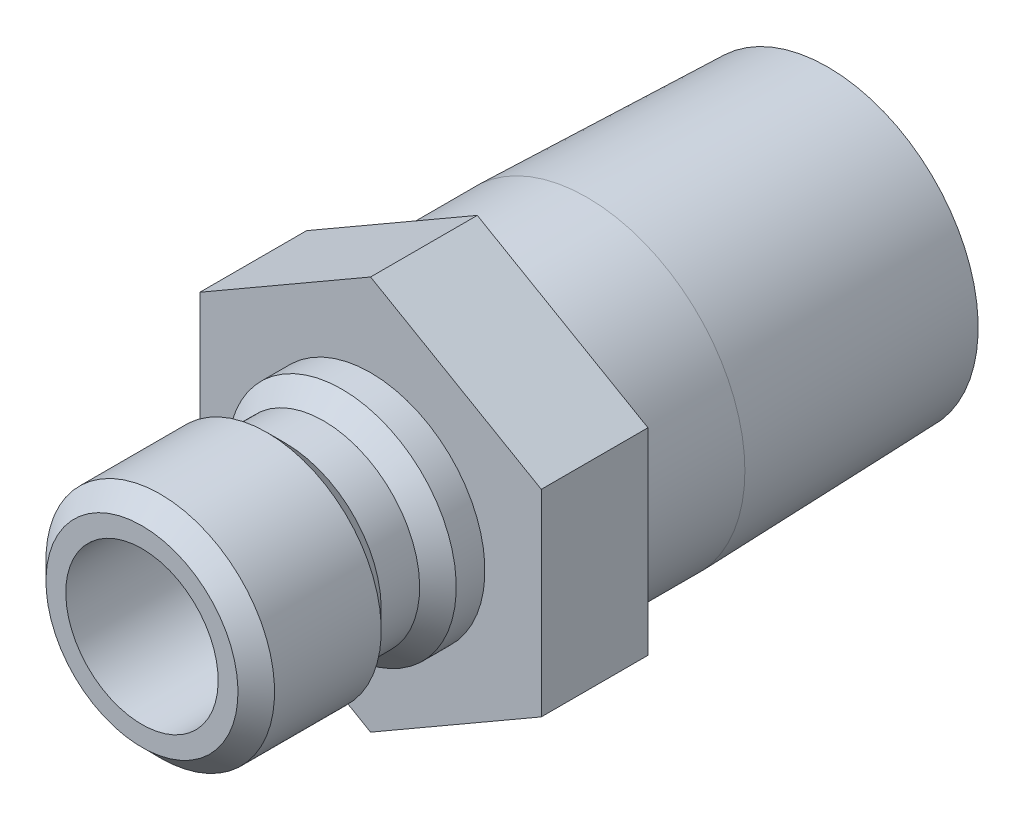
ISO-10303-21;
HEADER;
FILE_DESCRIPTION(('STEP AP214'),'2;1');
FILE_NAME('part.step','',(''),(''),'','','');
FILE_SCHEMA(('AUTOMOTIVE_DESIGN { 1 0 10303 214 1 1 1 1 }'));
ENDSEC;
DATA;
#1=APPLICATION_CONTEXT('core data for automotive mechanical design processes');
#2=APPLICATION_PROTOCOL_DEFINITION('international standard','automotive_design',2000,#1);
#3=PRODUCT_CONTEXT('',#1,'mechanical');
#4=PRODUCT('Part','Part','',(#3));
#5=PRODUCT_RELATED_PRODUCT_CATEGORY('part','',(#4));
#6=PRODUCT_DEFINITION_FORMATION('','',#4);
#7=PRODUCT_DEFINITION_CONTEXT('part definition',#1,'design');
#8=PRODUCT_DEFINITION('design','',#6,#7);
#9=PRODUCT_DEFINITION_SHAPE('','',#8);
#10=(LENGTH_UNIT() NAMED_UNIT(*) SI_UNIT(.MILLI.,.METRE.));
#11=(NAMED_UNIT(*) PLANE_ANGLE_UNIT() SI_UNIT($,.RADIAN.));
#12=(NAMED_UNIT(*) SI_UNIT($,.STERADIAN.) SOLID_ANGLE_UNIT());
#13=UNCERTAINTY_MEASURE_WITH_UNIT(LENGTH_MEASURE(1.E-05),#10,'distance_accuracy_value','');
#14=(GEOMETRIC_REPRESENTATION_CONTEXT(3) GLOBAL_UNCERTAINTY_ASSIGNED_CONTEXT((#13)) GLOBAL_UNIT_ASSIGNED_CONTEXT((#10,
#11,#12)) REPRESENTATION_CONTEXT('',''));
#15=CARTESIAN_POINT('',(0.,0.,0.));
#16=DIRECTION('',(0.,0.,1.));
#17=DIRECTION('',(1.,0.,0.));
#18=AXIS2_PLACEMENT_3D('',#15,#16,#17);
#19=CARTESIAN_POINT('',(0.,0.,0.));
#20=DIRECTION('',(0.,0.,-1.));
#21=DIRECTION('',(0.,1.,0.));
#22=AXIS2_PLACEMENT_3D('',#19,#20,#21);
#23=CYLINDRICAL_SURFACE('',#22,3.175);
#24=CARTESIAN_POINT('',(0.,0.,9.525));
#25=DIRECTION('',(0.,0.,-1.));
#26=DIRECTION('',(0.,1.,0.));
#27=AXIS2_PLACEMENT_3D('',#24,#25,#26);
#28=CIRCLE('',#27,3.175);
#29=CARTESIAN_POINT('',(0.,3.175,9.525));
#30=VERTEX_POINT('',#29);
#31=EDGE_CURVE('E151',#30,#30,#28,.T.);
#32=ORIENTED_EDGE('',*,*,#31,.F.);
#33=EDGE_LOOP('',(#32));
#34=FACE_BOUND('',#33,.T.);
#35=CARTESIAN_POINT('',(0.,0.,-4.445));
#36=DIRECTION('',(0.,0.,1.));
#37=DIRECTION('',(1.,0.,0.));
#38=AXIS2_PLACEMENT_3D('',#35,#36,#37);
#39=CIRCLE('',#38,3.175);
#40=CARTESIAN_POINT('',(3.175,0.,-4.445));
#41=VERTEX_POINT('',#40);
#42=EDGE_CURVE('E129',#41,#41,#39,.T.);
#43=ORIENTED_EDGE('',*,*,#42,.F.);
#44=EDGE_LOOP('',(#43));
#45=FACE_BOUND('',#44,.T.);
#46=ADVANCED_FACE('F37',(#34,#45),#23,.F.);
#47=CARTESIAN_POINT('',(0.,4.7625,0.));
#48=DIRECTION('',(0.,0.,1.));
#49=DIRECTION('',(0.,-1.,0.));
#50=AXIS2_PLACEMENT_3D('',#47,#48,#49);
#51=PLANE('',#50);
#52=CARTESIAN_POINT('',(0.,0.,0.));
#53=DIRECTION('',(0.,0.,-1.));
#54=DIRECTION('',(0.,1.,0.));
#55=AXIS2_PLACEMENT_3D('',#52,#53,#54);
#56=CIRCLE('',#55,4.7625);
#57=CARTESIAN_POINT('',(0.,4.7625,0.));
#58=VERTEX_POINT('',#57);
#59=EDGE_CURVE('E172',#58,#58,#56,.T.);
#60=ORIENTED_EDGE('',*,*,#59,.T.);
#61=EDGE_LOOP('',(#60));
#62=FACE_BOUND('',#61,.T.);
#63=DIRECTION('',(-0.866025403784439,-0.5,0.));
#64=VECTOR('',#63,1.);
#65=CARTESIAN_POINT('',(0.,8.21223022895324,0.));
#66=LINE('',#65,#64);
#67=CARTESIAN_POINT('',(0.,8.21223022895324,0.));
#68=VERTEX_POINT('',#67);
#69=CARTESIAN_POINT('',(-7.112,4.10611511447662,0.));
#70=VERTEX_POINT('',#69);
#71=EDGE_CURVE('E125',#68,#70,#66,.T.);
#72=ORIENTED_EDGE('',*,*,#71,.T.);
#73=DIRECTION('',(0.,-1.,0.));
#74=VECTOR('',#73,1.);
#75=CARTESIAN_POINT('',(-7.112,4.10611511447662,0.));
#76=LINE('',#75,#74);
#77=CARTESIAN_POINT('',(-7.112,-4.10611511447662,0.));
#78=VERTEX_POINT('',#77);
#79=EDGE_CURVE('E128',#70,#78,#76,.T.);
#80=ORIENTED_EDGE('',*,*,#79,.T.);
#81=DIRECTION('',(0.866025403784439,-0.5,0.));
#82=VECTOR('',#81,1.);
#83=CARTESIAN_POINT('',(-7.112,-4.10611511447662,0.));
#84=LINE('',#83,#82);
#85=CARTESIAN_POINT('',(0.,-8.21223022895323,0.));
#86=VERTEX_POINT('',#85);
#87=EDGE_CURVE('E132',#78,#86,#84,.T.);
#88=ORIENTED_EDGE('',*,*,#87,.T.);
#89=DIRECTION('',(0.866025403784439,0.5,0.));
#90=VECTOR('',#89,1.);
#91=CARTESIAN_POINT('',(0.,-8.21223022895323,0.));
#92=LINE('',#91,#90);
#93=CARTESIAN_POINT('',(7.112,-4.10611511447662,0.));
#94=VERTEX_POINT('',#93);
#95=EDGE_CURVE('E135',#86,#94,#92,.T.);
#96=ORIENTED_EDGE('',*,*,#95,.T.);
#97=DIRECTION('',(0.,1.,0.));
#98=VECTOR('',#97,1.);
#99=CARTESIAN_POINT('',(7.112,-4.10611511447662,0.));
#100=LINE('',#99,#98);
#101=CARTESIAN_POINT('',(7.112,4.10611511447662,0.));
#102=VERTEX_POINT('',#101);
#103=EDGE_CURVE('E102',#94,#102,#100,.T.);
#104=ORIENTED_EDGE('',*,*,#103,.T.);
#105=DIRECTION('',(-0.866025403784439,0.5,0.));
#106=VECTOR('',#105,1.);
#107=CARTESIAN_POINT('',(7.112,4.10611511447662,0.));
#108=LINE('',#107,#106);
#109=EDGE_CURVE('E138',#102,#68,#108,.T.);
#110=ORIENTED_EDGE('',*,*,#109,.T.);
#111=EDGE_LOOP('',(#72,#80,#88,#96,#104,#110));
#112=FACE_BOUND('',#111,.T.);
#113=ADVANCED_FACE('F199',(#62,#112),#51,.T.);
#114=CARTESIAN_POINT('',(0.,0.,0.));
#115=DIRECTION('',(0.,0.,-1.));
#116=DIRECTION('',(0.,1.,0.));
#117=AXIS2_PLACEMENT_3D('',#114,#115,#116);
#118=CYLINDRICAL_SURFACE('',#117,4.7625);
#119=CARTESIAN_POINT('',(0.,0.,1.1938));
#120=DIRECTION('',(0.,0.,-1.));
#121=DIRECTION('',(0.,1.,0.));
#122=AXIS2_PLACEMENT_3D('',#119,#120,#121);
#123=CIRCLE('',#122,4.7625);
#124=CARTESIAN_POINT('',(0.,4.7625,1.1938));
#125=VERTEX_POINT('',#124);
#126=EDGE_CURVE('E169',#125,#125,#123,.T.);
#127=ORIENTED_EDGE('',*,*,#126,.T.);
#128=EDGE_LOOP('',(#127));
#129=FACE_BOUND('',#128,.T.);
#130=ORIENTED_EDGE('',*,*,#59,.F.);
#131=EDGE_LOOP('',(#130));
#132=FACE_BOUND('',#131,.T.);
#133=ADVANCED_FACE('F204',(#129,#132),#118,.T.);
#134=CARTESIAN_POINT('',(0.,0.,1.1938));
#135=DIRECTION('',(0.,0.,-1.));
#136=DIRECTION('',(0.,1.,0.));
#137=AXIS2_PLACEMENT_3D('',#134,#135,#136);
#138=CONICAL_SURFACE('',#137,4.7625,0.785398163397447);
#139=CARTESIAN_POINT('',(0.,0.,1.9558));
#140=DIRECTION('',(0.,0.,-1.));
#141=DIRECTION('',(0.,1.,0.));
#142=AXIS2_PLACEMENT_3D('',#139,#140,#141);
#143=CIRCLE('',#142,4.0005);
#144=CARTESIAN_POINT('',(0.,4.0005,1.9558));
#145=VERTEX_POINT('',#144);
#146=EDGE_CURVE('E166',#145,#145,#143,.T.);
#147=ORIENTED_EDGE('',*,*,#146,.T.);
#148=EDGE_LOOP('',(#147));
#149=FACE_BOUND('',#148,.T.);
#150=ORIENTED_EDGE('',*,*,#126,.F.);
#151=EDGE_LOOP('',(#150));
#152=FACE_BOUND('',#151,.T.);
#153=ADVANCED_FACE('F253',(#149,#152),#138,.T.);
#154=CARTESIAN_POINT('',(0.,0.,0.));
#155=DIRECTION('',(0.,0.,-1.));
#156=DIRECTION('',(0.,1.,0.));
#157=AXIS2_PLACEMENT_3D('',#154,#155,#156);
#158=CYLINDRICAL_SURFACE('',#157,4.0005);
#159=CARTESIAN_POINT('',(0.,0.,3.556));
#160=DIRECTION('',(0.,0.,-1.));
#161=DIRECTION('',(0.,1.,0.));
#162=AXIS2_PLACEMENT_3D('',#159,#160,#161);
#163=CIRCLE('',#162,4.0005);
#164=CARTESIAN_POINT('',(0.,4.0005,3.556));
#165=VERTEX_POINT('',#164);
#166=EDGE_CURVE('E163',#165,#165,#163,.T.);
#167=ORIENTED_EDGE('',*,*,#166,.T.);
#168=EDGE_LOOP('',(#167));
#169=FACE_BOUND('',#168,.T.);
#170=ORIENTED_EDGE('',*,*,#146,.F.);
#171=EDGE_LOOP('',(#170));
#172=FACE_BOUND('',#171,.T.);
#173=ADVANCED_FACE('F249',(#169,#172),#158,.T.);
#174=CARTESIAN_POINT('',(0.,0.,3.556));
#175=DIRECTION('',(0.,0.,1.));
#176=DIRECTION('',(0.,-1.,0.));
#177=AXIS2_PLACEMENT_3D('',#174,#175,#176);
#178=CONICAL_SURFACE('',#177,4.0005,0.785398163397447);
#179=CARTESIAN_POINT('',(0.,0.,4.318));
#180=DIRECTION('',(0.,0.,-1.));
#181=DIRECTION('',(0.,1.,0.));
#182=AXIS2_PLACEMENT_3D('',#179,#180,#181);
#183=CIRCLE('',#182,4.7625);
#184=CARTESIAN_POINT('',(0.,4.7625,4.318));
#185=VERTEX_POINT('',#184);
#186=EDGE_CURVE('E160',#185,#185,#183,.T.);
#187=ORIENTED_EDGE('',*,*,#186,.T.);
#188=EDGE_LOOP('',(#187));
#189=FACE_BOUND('',#188,.T.);
#190=ORIENTED_EDGE('',*,*,#166,.F.);
#191=EDGE_LOOP('',(#190));
#192=FACE_BOUND('',#191,.T.);
#193=ADVANCED_FACE('F245',(#189,#192),#178,.T.);
#194=CARTESIAN_POINT('',(0.,0.,0.));
#195=DIRECTION('',(0.,0.,-1.));
#196=DIRECTION('',(0.,1.,0.));
#197=AXIS2_PLACEMENT_3D('',#194,#195,#196);
#198=CYLINDRICAL_SURFACE('',#197,4.7625);
#199=CARTESIAN_POINT('',(0.,0.,8.763));
#200=DIRECTION('',(0.,0.,-1.));
#201=DIRECTION('',(0.,1.,0.));
#202=AXIS2_PLACEMENT_3D('',#199,#200,#201);
#203=CIRCLE('',#202,4.7625);
#204=CARTESIAN_POINT('',(0.,4.7625,8.763));
#205=VERTEX_POINT('',#204);
#206=EDGE_CURVE('E157',#205,#205,#203,.T.);
#207=ORIENTED_EDGE('',*,*,#206,.T.);
#208=EDGE_LOOP('',(#207));
#209=FACE_BOUND('',#208,.T.);
#210=ORIENTED_EDGE('',*,*,#186,.F.);
#211=EDGE_LOOP('',(#210));
#212=FACE_BOUND('',#211,.T.);
#213=ADVANCED_FACE('F241',(#209,#212),#198,.T.);
#214=CARTESIAN_POINT('',(0.,0.,8.763));
#215=DIRECTION('',(0.,0.,-1.));
#216=DIRECTION('',(0.,1.,0.));
#217=AXIS2_PLACEMENT_3D('',#214,#215,#216);
#218=CONICAL_SURFACE('',#217,4.7625,0.785398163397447);
#219=CARTESIAN_POINT('',(0.,0.,9.525));
#220=DIRECTION('',(0.,0.,-1.));
#221=DIRECTION('',(0.,1.,0.));
#222=AXIS2_PLACEMENT_3D('',#219,#220,#221);
#223=CIRCLE('',#222,4.0005);
#224=CARTESIAN_POINT('',(0.,4.0005,9.525));
#225=VERTEX_POINT('',#224);
#226=EDGE_CURVE('E154',#225,#225,#223,.T.);
#227=ORIENTED_EDGE('',*,*,#226,.T.);
#228=EDGE_LOOP('',(#227));
#229=FACE_BOUND('',#228,.T.);
#230=ORIENTED_EDGE('',*,*,#206,.F.);
#231=EDGE_LOOP('',(#230));
#232=FACE_BOUND('',#231,.T.);
#233=ADVANCED_FACE('F226',(#229,#232),#218,.T.);
#234=CARTESIAN_POINT('',(0.,3.175,9.525));
#235=DIRECTION('',(0.,0.,1.));
#236=DIRECTION('',(0.,-1.,0.));
#237=AXIS2_PLACEMENT_3D('',#234,#235,#236);
#238=PLANE('',#237);
#239=ORIENTED_EDGE('',*,*,#31,.T.);
#240=EDGE_LOOP('',(#239));
#241=FACE_BOUND('',#240,.T.);
#242=ORIENTED_EDGE('',*,*,#226,.F.);
#243=EDGE_LOOP('',(#242));
#244=FACE_BOUND('',#243,.T.);
#245=ADVANCED_FACE('F219',(#241,#244),#238,.T.);
#246=CARTESIAN_POINT('',(7.112,4.10611511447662,-4.445));
#247=DIRECTION('',(0.5,0.866025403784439,0.));
#248=DIRECTION('',(-0.866025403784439,0.5,0.));
#249=AXIS2_PLACEMENT_3D('',#246,#247,#248);
#250=PLANE('',#249);
#251=ORIENTED_EDGE('',*,*,#109,.F.);
#252=DIRECTION('',(0.,0.,1.));
#253=VECTOR('',#252,1.);
#254=CARTESIAN_POINT('',(7.112,4.10611511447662,-4.445));
#255=LINE('',#254,#253);
#256=CARTESIAN_POINT('',(7.112,4.10611511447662,-4.445));
#257=VERTEX_POINT('',#256);
#258=EDGE_CURVE('E77',#257,#102,#255,.T.);
#259=ORIENTED_EDGE('',*,*,#258,.F.);
#260=DIRECTION('',(-0.866025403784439,0.5,0.));
#261=VECTOR('',#260,1.);
#262=CARTESIAN_POINT('',(7.112,4.10611511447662,-4.445));
#263=LINE('',#262,#261);
#264=CARTESIAN_POINT('',(0.,8.21223022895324,-4.445));
#265=VERTEX_POINT('',#264);
#266=EDGE_CURVE('E115',#257,#265,#263,.T.);
#267=ORIENTED_EDGE('',*,*,#266,.T.);
#268=DIRECTION('',(0.,0.,1.));
#269=VECTOR('',#268,1.);
#270=CARTESIAN_POINT('',(0.,8.21223022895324,-4.445));
#271=LINE('',#270,#269);
#272=EDGE_CURVE('E54',#265,#68,#271,.T.);
#273=ORIENTED_EDGE('',*,*,#272,.T.);
#274=EDGE_LOOP('',(#251,#259,#267,#273));
#275=FACE_BOUND('',#274,.T.);
#276=ADVANCED_FACE('F217',(#275),#250,.T.);
#277=CARTESIAN_POINT('',(7.112,-4.10611511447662,-4.445));
#278=DIRECTION('',(1.,0.,0.));
#279=DIRECTION('',(0.,1.,0.));
#280=AXIS2_PLACEMENT_3D('',#277,#278,#279);
#281=PLANE('',#280);
#282=ORIENTED_EDGE('',*,*,#103,.F.);
#283=DIRECTION('',(0.,0.,1.));
#284=VECTOR('',#283,1.);
#285=CARTESIAN_POINT('',(7.112,-4.10611511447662,-4.445));
#286=LINE('',#285,#284);
#287=CARTESIAN_POINT('',(7.112,-4.10611511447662,-4.445));
#288=VERTEX_POINT('',#287);
#289=EDGE_CURVE('E97',#288,#94,#286,.T.);
#290=ORIENTED_EDGE('',*,*,#289,.F.);
#291=DIRECTION('',(0.,1.,0.));
#292=VECTOR('',#291,1.);
#293=CARTESIAN_POINT('',(7.112,-4.10611511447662,-4.445));
#294=LINE('',#293,#292);
#295=EDGE_CURVE('E100',#288,#257,#294,.T.);
#296=ORIENTED_EDGE('',*,*,#295,.T.);
#297=ORIENTED_EDGE('',*,*,#258,.T.);
#298=EDGE_LOOP('',(#282,#290,#296,#297));
#299=FACE_BOUND('',#298,.T.);
#300=ADVANCED_FACE('F99',(#299),#281,.T.);
#301=CARTESIAN_POINT('',(0.,-8.21223022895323,-4.445));
#302=DIRECTION('',(0.5,-0.866025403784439,0.));
#303=DIRECTION('',(0.866025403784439,0.5,0.));
#304=AXIS2_PLACEMENT_3D('',#301,#302,#303);
#305=PLANE('',#304);
#306=ORIENTED_EDGE('',*,*,#95,.F.);
#307=DIRECTION('',(0.,0.,1.));
#308=VECTOR('',#307,1.);
#309=CARTESIAN_POINT('',(0.,-8.21223022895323,-4.445));
#310=LINE('',#309,#308);
#311=CARTESIAN_POINT('',(0.,-8.21223022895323,-4.445));
#312=VERTEX_POINT('',#311);
#313=EDGE_CURVE('E107',#312,#86,#310,.T.);
#314=ORIENTED_EDGE('',*,*,#313,.F.);
#315=DIRECTION('',(0.866025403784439,0.5,0.));
#316=VECTOR('',#315,1.);
#317=CARTESIAN_POINT('',(0.,-8.21223022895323,-4.445));
#318=LINE('',#317,#316);
#319=EDGE_CURVE('E113',#312,#288,#318,.T.);
#320=ORIENTED_EDGE('',*,*,#319,.T.);
#321=ORIENTED_EDGE('',*,*,#289,.T.);
#322=EDGE_LOOP('',(#306,#314,#320,#321));
#323=FACE_BOUND('',#322,.T.);
#324=ADVANCED_FACE('F117',(#323),#305,.T.);
#325=CARTESIAN_POINT('',(-7.112,-4.10611511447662,-4.445));
#326=DIRECTION('',(-0.5,-0.866025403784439,0.));
#327=DIRECTION('',(0.866025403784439,-0.5,0.));
#328=AXIS2_PLACEMENT_3D('',#325,#326,#327);
#329=PLANE('',#328);
#330=ORIENTED_EDGE('',*,*,#87,.F.);
#331=DIRECTION('',(0.,0.,1.));
#332=VECTOR('',#331,1.);
#333=CARTESIAN_POINT('',(-7.112,-4.10611511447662,-4.445));
#334=LINE('',#333,#332);
#335=CARTESIAN_POINT('',(-7.112,-4.10611511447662,-4.445));
#336=VERTEX_POINT('',#335);
#337=EDGE_CURVE('E145',#336,#78,#334,.T.);
#338=ORIENTED_EDGE('',*,*,#337,.F.);
#339=DIRECTION('',(0.866025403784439,-0.5,0.));
#340=VECTOR('',#339,1.);
#341=CARTESIAN_POINT('',(-7.112,-4.10611511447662,-4.445));
#342=LINE('',#341,#340);
#343=EDGE_CURVE('E118',#336,#312,#342,.T.);
#344=ORIENTED_EDGE('',*,*,#343,.T.);
#345=ORIENTED_EDGE('',*,*,#313,.T.);
#346=EDGE_LOOP('',(#330,#338,#344,#345));
#347=FACE_BOUND('',#346,.T.);
#348=ADVANCED_FACE('F233',(#347),#329,.T.);
#349=CARTESIAN_POINT('',(-7.112,4.10611511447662,-4.445));
#350=DIRECTION('',(-1.,0.,0.));
#351=DIRECTION('',(0.,-1.,0.));
#352=AXIS2_PLACEMENT_3D('',#349,#350,#351);
#353=PLANE('',#352);
#354=ORIENTED_EDGE('',*,*,#79,.F.);
#355=DIRECTION('',(0.,0.,1.));
#356=VECTOR('',#355,1.);
#357=CARTESIAN_POINT('',(-7.112,4.10611511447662,-4.445));
#358=LINE('',#357,#356);
#359=CARTESIAN_POINT('',(-7.112,4.10611511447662,-4.445));
#360=VERTEX_POINT('',#359);
#361=EDGE_CURVE('E89',#360,#70,#358,.T.);
#362=ORIENTED_EDGE('',*,*,#361,.F.);
#363=DIRECTION('',(0.,-1.,0.));
#364=VECTOR('',#363,1.);
#365=CARTESIAN_POINT('',(-7.112,4.10611511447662,-4.445));
#366=LINE('',#365,#364);
#367=EDGE_CURVE('E120',#360,#336,#366,.T.);
#368=ORIENTED_EDGE('',*,*,#367,.T.);
#369=ORIENTED_EDGE('',*,*,#337,.T.);
#370=EDGE_LOOP('',(#354,#362,#368,#369));
#371=FACE_BOUND('',#370,.T.);
#372=ADVANCED_FACE('F214',(#371),#353,.T.);
#373=CARTESIAN_POINT('',(-7.112,4.10611511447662,-4.445));
#374=DIRECTION('',(0.,0.,1.));
#375=DIRECTION('',(1.,0.,0.));
#376=AXIS2_PLACEMENT_3D('',#373,#374,#375);
#377=PLANE('',#376);
#378=CARTESIAN_POINT('',(0.,0.,-4.445));
#379=DIRECTION('',(0.,0.,1.));
#380=DIRECTION('',(1.,0.,0.));
#381=AXIS2_PLACEMENT_3D('',#378,#379,#380);
#382=CIRCLE('',#381,6.5786);
#383=CARTESIAN_POINT('',(6.5786,0.,-4.445));
#384=VERTEX_POINT('',#383);
#385=EDGE_CURVE('E40',#384,#384,#382,.F.);
#386=ORIENTED_EDGE('',*,*,#385,.F.);
#387=EDGE_LOOP('',(#386));
#388=FACE_BOUND('',#387,.T.);
#389=DIRECTION('',(-0.866025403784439,-0.5,0.));
#390=VECTOR('',#389,1.);
#391=CARTESIAN_POINT('',(0.,8.21223022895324,-4.445));
#392=LINE('',#391,#390);
#393=EDGE_CURVE('E141',#265,#360,#392,.T.);
#394=ORIENTED_EDGE('',*,*,#393,.F.);
#395=ORIENTED_EDGE('',*,*,#266,.F.);
#396=ORIENTED_EDGE('',*,*,#295,.F.);
#397=ORIENTED_EDGE('',*,*,#319,.F.);
#398=ORIENTED_EDGE('',*,*,#343,.F.);
#399=ORIENTED_EDGE('',*,*,#367,.F.);
#400=EDGE_LOOP('',(#394,#395,#396,#397,#398,#399));
#401=FACE_BOUND('',#400,.T.);
#402=ADVANCED_FACE('F111',(#388,#401),#377,.F.);
#403=CARTESIAN_POINT('',(0.,8.21223022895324,-4.445));
#404=DIRECTION('',(-0.5,0.866025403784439,0.));
#405=DIRECTION('',(-0.866025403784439,-0.5,0.));
#406=AXIS2_PLACEMENT_3D('',#403,#404,#405);
#407=PLANE('',#406);
#408=ORIENTED_EDGE('',*,*,#71,.F.);
#409=ORIENTED_EDGE('',*,*,#272,.F.);
#410=ORIENTED_EDGE('',*,*,#393,.T.);
#411=ORIENTED_EDGE('',*,*,#361,.T.);
#412=EDGE_LOOP('',(#408,#409,#410,#411));
#413=FACE_BOUND('',#412,.T.);
#414=ADVANCED_FACE('F187',(#413),#407,.T.);
#415=CARTESIAN_POINT('',(0.,0.,-19.05));
#416=DIRECTION('',(0.,0.,1.));
#417=DIRECTION('',(0.,-1.,0.));
#418=AXIS2_PLACEMENT_3D('',#415,#416,#417);
#419=CONICAL_SURFACE('',#418,6.26507060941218,0.0312396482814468);
#420=CARTESIAN_POINT('',(0.,0.,-9.017));
#421=DIRECTION('',(0.,0.,-1.));
#422=DIRECTION('',(0.,1.,0.));
#423=AXIS2_PLACEMENT_3D('',#420,#421,#422);
#424=CIRCLE('',#423,6.5786);
#425=CARTESIAN_POINT('',(0.,6.5786,-9.017));
#426=VERTEX_POINT('',#425);
#427=EDGE_CURVE('E175',#426,#426,#424,.T.);
#428=ORIENTED_EDGE('',*,*,#427,.T.);
#429=EDGE_LOOP('',(#428));
#430=FACE_BOUND('',#429,.T.);
#431=CARTESIAN_POINT('',(0.,0.,-19.05));
#432=DIRECTION('',(0.,0.,-1.));
#433=DIRECTION('',(0.,1.,0.));
#434=AXIS2_PLACEMENT_3D('',#431,#432,#433);
#435=CIRCLE('',#434,6.26507060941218);
#436=CARTESIAN_POINT('',(0.,6.26507060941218,-19.05));
#437=VERTEX_POINT('',#436);
#438=EDGE_CURVE('E46',#437,#437,#435,.T.);
#439=ORIENTED_EDGE('',*,*,#438,.F.);
#440=EDGE_LOOP('',(#439));
#441=FACE_BOUND('',#440,.T.);
#442=ADVANCED_FACE('F184',(#430,#441),#419,.T.);
#443=CARTESIAN_POINT('',(0.,0.,0.));
#444=DIRECTION('',(0.,0.,-1.));
#445=DIRECTION('',(0.,1.,0.));
#446=AXIS2_PLACEMENT_3D('',#443,#444,#445);
#447=CYLINDRICAL_SURFACE('',#446,6.5786);
#448=ORIENTED_EDGE('',*,*,#427,.F.);
#449=EDGE_LOOP('',(#448));
#450=FACE_BOUND('',#449,.T.);
#451=ORIENTED_EDGE('',*,*,#385,.T.);
#452=EDGE_LOOP('',(#451));
#453=FACE_BOUND('',#452,.T.);
#454=ADVANCED_FACE('F186',(#450,#453),#447,.T.);
#455=CARTESIAN_POINT('',(0.,6.26507060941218,-19.05));
#456=DIRECTION('',(0.,0.,-1.));
#457=DIRECTION('',(0.,1.,0.));
#458=AXIS2_PLACEMENT_3D('',#455,#456,#457);
#459=PLANE('',#458);
#460=ORIENTED_EDGE('',*,*,#438,.T.);
#461=EDGE_LOOP('',(#460));
#462=FACE_BOUND('',#461,.T.);
#463=CARTESIAN_POINT('',(0.,0.,-19.05));
#464=DIRECTION('',(0.,0.,-1.));
#465=DIRECTION('',(0.,1.,0.));
#466=AXIS2_PLACEMENT_3D('',#463,#464,#465);
#467=CIRCLE('',#466,4.6228);
#468=CARTESIAN_POINT('',(0.,4.6228,-19.05));
#469=VERTEX_POINT('',#468);
#470=EDGE_CURVE('E11',#469,#469,#467,.T.);
#471=ORIENTED_EDGE('',*,*,#470,.F.);
#472=EDGE_LOOP('',(#471));
#473=FACE_BOUND('',#472,.T.);
#474=ADVANCED_FACE('F181',(#462,#473),#459,.T.);
#475=CARTESIAN_POINT('',(0.,0.,0.));
#476=DIRECTION('',(0.,0.,-1.));
#477=DIRECTION('',(0.,1.,0.));
#478=AXIS2_PLACEMENT_3D('',#475,#476,#477);
#479=CYLINDRICAL_SURFACE('',#478,4.6228);
#480=ORIENTED_EDGE('',*,*,#470,.T.);
#481=EDGE_LOOP('',(#480));
#482=FACE_BOUND('',#481,.T.);
#483=CARTESIAN_POINT('',(0.,0.,-4.445));
#484=DIRECTION('',(0.,0.,1.));
#485=DIRECTION('',(1.,0.,0.));
#486=AXIS2_PLACEMENT_3D('',#483,#484,#485);
#487=CIRCLE('',#486,4.6228);
#488=CARTESIAN_POINT('',(4.6228,0.,-4.445));
#489=VERTEX_POINT('',#488);
#490=EDGE_CURVE('E148',#489,#489,#487,.T.);
#491=ORIENTED_EDGE('',*,*,#490,.T.);
#492=EDGE_LOOP('',(#491));
#493=FACE_BOUND('',#492,.T.);
#494=ADVANCED_FACE('F368',(#482,#493),#479,.F.);
#495=ORIENTED_EDGE('',*,*,#490,.F.);
#496=EDGE_LOOP('',(#495));
#497=FACE_BOUND('',#496,.T.);
#498=ORIENTED_EDGE('',*,*,#42,.T.);
#499=EDGE_LOOP('',(#498));
#500=FACE_BOUND('',#499,.T.);
#501=ADVANCED_FACE('F348',(#497,#500),#377,.F.);
#502=CLOSED_SHELL('',(#46,#113,#133,#153,#173,#193,#213,#233,#245,#276,#300,#324,#348,#372,#402,
#414,#442,#454,#474,#494,#501));
#503=MANIFOLD_SOLID_BREP('B2',#502);
#504=ADVANCED_BREP_SHAPE_REPRESENTATION('',(#18,#503),#14);
#505=SHAPE_DEFINITION_REPRESENTATION(#9,#504);
ENDSEC;
END-ISO-10303-21;
